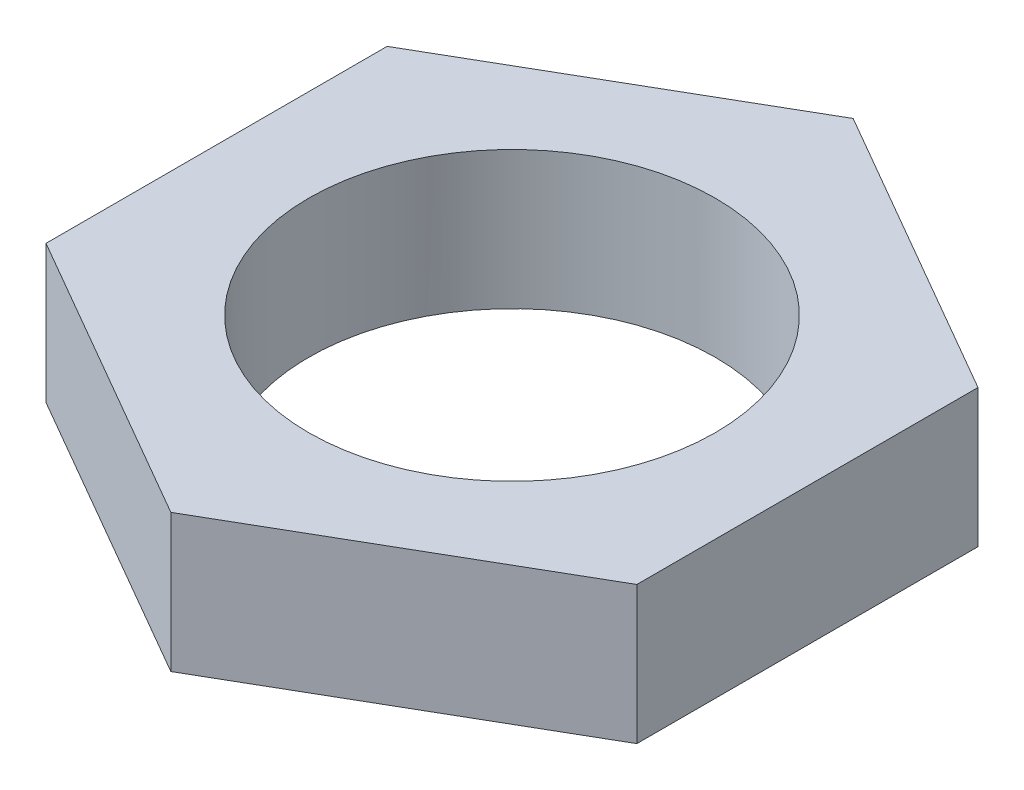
ISO-10303-21;
HEADER;
FILE_DESCRIPTION(('STEP AP214'),'2;1');
FILE_NAME('part.step','',(''),(''),'','','');
FILE_SCHEMA(('AUTOMOTIVE_DESIGN { 1 0 10303 214 1 1 1 1 }'));
ENDSEC;
DATA;
#1=APPLICATION_CONTEXT('core data for automotive mechanical design processes');
#2=APPLICATION_PROTOCOL_DEFINITION('international standard','automotive_design',2000,#1);
#3=PRODUCT_CONTEXT('',#1,'mechanical');
#4=PRODUCT('Part','Part','',(#3));
#5=PRODUCT_RELATED_PRODUCT_CATEGORY('part','',(#4));
#6=PRODUCT_DEFINITION_FORMATION('','',#4);
#7=PRODUCT_DEFINITION_CONTEXT('part definition',#1,'design');
#8=PRODUCT_DEFINITION('design','',#6,#7);
#9=PRODUCT_DEFINITION_SHAPE('','',#8);
#10=(LENGTH_UNIT() NAMED_UNIT(*) SI_UNIT(.MILLI.,.METRE.));
#11=(NAMED_UNIT(*) PLANE_ANGLE_UNIT() SI_UNIT($,.RADIAN.));
#12=(NAMED_UNIT(*) SI_UNIT($,.STERADIAN.) SOLID_ANGLE_UNIT());
#13=UNCERTAINTY_MEASURE_WITH_UNIT(LENGTH_MEASURE(1.E-05),#10,'distance_accuracy_value','');
#14=(GEOMETRIC_REPRESENTATION_CONTEXT(3) GLOBAL_UNCERTAINTY_ASSIGNED_CONTEXT((#13)) GLOBAL_UNIT_ASSIGNED_CONTEXT((#10,
#11,#12)) REPRESENTATION_CONTEXT('',''));
#15=CARTESIAN_POINT('',(0.,0.,0.));
#16=DIRECTION('',(0.,0.,1.));
#17=DIRECTION('',(1.,0.,0.));
#18=AXIS2_PLACEMENT_3D('',#15,#16,#17);
#19=CARTESIAN_POINT('',(15.0000000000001,7.00000000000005,-8.66025403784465));
#20=DIRECTION('',(-0.500000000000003,0.,0.866025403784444));
#21=DIRECTION('',(0.866025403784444,0.,0.500000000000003));
#22=AXIS2_PLACEMENT_3D('',#19,#20,#21);
#23=PLANE('',#22);
#24=DIRECTION('',(-0.866025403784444,0.,-0.500000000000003));
#25=VECTOR('',#24,1.);
#26=CARTESIAN_POINT('',(15.0000000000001,0.,-8.66025403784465));
#27=LINE('',#26,#25);
#28=CARTESIAN_POINT('',(15.0000000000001,0.,-8.66025403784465));
#29=VERTEX_POINT('',#28);
#30=CARTESIAN_POINT('',(0.,0.,-17.320508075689));
#31=VERTEX_POINT('',#30);
#32=EDGE_CURVE('E121',#29,#31,#27,.T.);
#33=ORIENTED_EDGE('',*,*,#32,.T.);
#34=DIRECTION('',(0.,-1.,0.));
#35=VECTOR('',#34,1.);
#36=CARTESIAN_POINT('',(0.,7.00000000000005,-17.3205080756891));
#37=LINE('',#36,#35);
#38=CARTESIAN_POINT('',(0.,7.00000000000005,-17.3205080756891));
#39=VERTEX_POINT('',#38);
#40=EDGE_CURVE('E11',#39,#31,#37,.T.);
#41=ORIENTED_EDGE('',*,*,#40,.F.);
#42=DIRECTION('',(-0.866025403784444,0.,-0.500000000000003));
#43=VECTOR('',#42,1.);
#44=CARTESIAN_POINT('',(15.0000000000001,7.00000000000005,-8.66025403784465));
#45=LINE('',#44,#43);
#46=CARTESIAN_POINT('',(15.0000000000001,7.00000000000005,-8.66025403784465));
#47=VERTEX_POINT('',#46);
#48=EDGE_CURVE('E132',#47,#39,#45,.T.);
#49=ORIENTED_EDGE('',*,*,#48,.F.);
#50=DIRECTION('',(0.,-1.,0.));
#51=VECTOR('',#50,1.);
#52=CARTESIAN_POINT('',(15.0000000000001,7.00000000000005,-8.66025403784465));
#53=LINE('',#52,#51);
#54=EDGE_CURVE('E117',#47,#29,#53,.T.);
#55=ORIENTED_EDGE('',*,*,#54,.T.);
#56=EDGE_LOOP('',(#33,#41,#49,#55));
#57=FACE_BOUND('',#56,.T.);
#58=ADVANCED_FACE('F37',(#57),#23,.F.);
#59=CARTESIAN_POINT('',(0.,7.00000000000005,-17.3205080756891));
#60=DIRECTION('',(0.500000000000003,0.,0.866025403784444));
#61=DIRECTION('',(0.866025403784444,0.,-0.500000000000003));
#62=AXIS2_PLACEMENT_3D('',#59,#60,#61);
#63=PLANE('',#62);
#64=DIRECTION('',(-0.866025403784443,0.,0.500000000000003));
#65=VECTOR('',#64,1.);
#66=CARTESIAN_POINT('',(0.,0.,-17.320508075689));
#67=LINE('',#66,#65);
#68=CARTESIAN_POINT('',(-15.0000000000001,0.,-8.66025403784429));
#69=VERTEX_POINT('',#68);
#70=EDGE_CURVE('E124',#31,#69,#67,.T.);
#71=ORIENTED_EDGE('',*,*,#70,.T.);
#72=DIRECTION('',(0.,-1.,0.));
#73=VECTOR('',#72,1.);
#74=CARTESIAN_POINT('',(-15.,7.00000000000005,-8.66025403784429));
#75=LINE('',#74,#73);
#76=CARTESIAN_POINT('',(-15.,7.00000000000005,-8.66025403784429));
#77=VERTEX_POINT('',#76);
#78=EDGE_CURVE('E45',#77,#69,#75,.T.);
#79=ORIENTED_EDGE('',*,*,#78,.F.);
#80=DIRECTION('',(-0.866025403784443,0.,0.500000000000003));
#81=VECTOR('',#80,1.);
#82=CARTESIAN_POINT('',(0.,7.00000000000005,-17.3205080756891));
#83=LINE('',#82,#81);
#84=EDGE_CURVE('E90',#39,#77,#83,.T.);
#85=ORIENTED_EDGE('',*,*,#84,.F.);
#86=ORIENTED_EDGE('',*,*,#40,.T.);
#87=EDGE_LOOP('',(#71,#79,#85,#86));
#88=FACE_BOUND('',#87,.T.);
#89=ADVANCED_FACE('F157',(#88),#63,.F.);
#90=CARTESIAN_POINT('',(-15.,7.00000000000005,-8.66025403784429));
#91=DIRECTION('',(1.00000000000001,0.,0.));
#92=DIRECTION('',(0.,0.,-1.00000000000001));
#93=AXIS2_PLACEMENT_3D('',#90,#91,#92);
#94=PLANE('',#93);
#95=DIRECTION('',(0.,0.,1.00000000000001));
#96=VECTOR('',#95,1.);
#97=CARTESIAN_POINT('',(-15.0000000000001,0.,-8.66025403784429));
#98=LINE('',#97,#96);
#99=CARTESIAN_POINT('',(-15.0000000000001,0.,8.66025403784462));
#100=VERTEX_POINT('',#99);
#101=EDGE_CURVE('E127',#69,#100,#98,.T.);
#102=ORIENTED_EDGE('',*,*,#101,.T.);
#103=DIRECTION('',(0.,-1.,0.));
#104=VECTOR('',#103,1.);
#105=CARTESIAN_POINT('',(-15.,7.00000000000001,8.66025403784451));
#106=LINE('',#105,#104);
#107=CARTESIAN_POINT('',(-15.,7.00000000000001,8.66025403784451));
#108=VERTEX_POINT('',#107);
#109=EDGE_CURVE('E112',#108,#100,#106,.T.);
#110=ORIENTED_EDGE('',*,*,#109,.F.);
#111=DIRECTION('',(0.,0.,1.00000000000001));
#112=VECTOR('',#111,1.);
#113=CARTESIAN_POINT('',(-15.,7.00000000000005,-8.66025403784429));
#114=LINE('',#113,#112);
#115=EDGE_CURVE('E103',#77,#108,#114,.T.);
#116=ORIENTED_EDGE('',*,*,#115,.F.);
#117=ORIENTED_EDGE('',*,*,#78,.T.);
#118=EDGE_LOOP('',(#102,#110,#116,#117));
#119=FACE_BOUND('',#118,.T.);
#120=ADVANCED_FACE('F138',(#119),#94,.F.);
#121=CARTESIAN_POINT('',(-15.,7.00000000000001,8.66025403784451));
#122=DIRECTION('',(0.500000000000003,0.,-0.866025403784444));
#123=DIRECTION('',(-0.866025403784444,0.,-0.500000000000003));
#124=AXIS2_PLACEMENT_3D('',#121,#122,#123);
#125=PLANE('',#124);
#126=DIRECTION('',(0.866025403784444,0.,0.500000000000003));
#127=VECTOR('',#126,1.);
#128=CARTESIAN_POINT('',(-15.0000000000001,0.,8.66025403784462));
#129=LINE('',#128,#127);
#130=CARTESIAN_POINT('',(-1.11022302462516E-13,0.,17.3205080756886));
#131=VERTEX_POINT('',#130);
#132=EDGE_CURVE('E111',#100,#131,#129,.T.);
#133=ORIENTED_EDGE('',*,*,#132,.T.);
#134=DIRECTION('',(0.,-1.,0.));
#135=VECTOR('',#134,1.);
#136=CARTESIAN_POINT('',(-1.11022302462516E-13,7.00000000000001,17.3205080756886));
#137=LINE('',#136,#135);
#138=CARTESIAN_POINT('',(-1.11022302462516E-13,7.00000000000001,17.3205080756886));
#139=VERTEX_POINT('',#138);
#140=EDGE_CURVE('E108',#139,#131,#137,.T.);
#141=ORIENTED_EDGE('',*,*,#140,.F.);
#142=DIRECTION('',(0.866025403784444,0.,0.500000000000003));
#143=VECTOR('',#142,1.);
#144=CARTESIAN_POINT('',(-15.,7.00000000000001,8.66025403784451));
#145=LINE('',#144,#143);
#146=EDGE_CURVE('E97',#108,#139,#145,.T.);
#147=ORIENTED_EDGE('',*,*,#146,.F.);
#148=ORIENTED_EDGE('',*,*,#109,.T.);
#149=EDGE_LOOP('',(#133,#141,#147,#148));
#150=FACE_BOUND('',#149,.T.);
#151=ADVANCED_FACE('F109',(#150),#125,.F.);
#152=CARTESIAN_POINT('',(-1.11022302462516E-13,7.00000000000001,17.3205080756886));
#153=DIRECTION('',(-0.500000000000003,0.,-0.866025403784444));
#154=DIRECTION('',(-0.866025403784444,0.,0.500000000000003));
#155=AXIS2_PLACEMENT_3D('',#152,#153,#154);
#156=PLANE('',#155);
#157=DIRECTION('',(0.866025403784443,0.,-0.500000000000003));
#158=VECTOR('',#157,1.);
#159=CARTESIAN_POINT('',(-1.11022302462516E-13,0.,17.3205080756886));
#160=LINE('',#159,#158);
#161=CARTESIAN_POINT('',(14.9999999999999,0.,8.66025403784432));
#162=VERTEX_POINT('',#161);
#163=EDGE_CURVE('E76',#131,#162,#160,.T.);
#164=ORIENTED_EDGE('',*,*,#163,.T.);
#165=DIRECTION('',(0.,-1.,0.));
#166=VECTOR('',#165,1.);
#167=CARTESIAN_POINT('',(14.9999999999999,7.00000000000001,8.66025403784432));
#168=LINE('',#167,#166);
#169=CARTESIAN_POINT('',(14.9999999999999,7.00000000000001,8.66025403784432));
#170=VERTEX_POINT('',#169);
#171=EDGE_CURVE('E113',#170,#162,#168,.T.);
#172=ORIENTED_EDGE('',*,*,#171,.F.);
#173=DIRECTION('',(0.866025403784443,0.,-0.500000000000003));
#174=VECTOR('',#173,1.);
#175=CARTESIAN_POINT('',(-1.11022302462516E-13,7.00000000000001,17.3205080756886));
#176=LINE('',#175,#174);
#177=EDGE_CURVE('E101',#139,#170,#176,.T.);
#178=ORIENTED_EDGE('',*,*,#177,.F.);
#179=ORIENTED_EDGE('',*,*,#140,.T.);
#180=EDGE_LOOP('',(#164,#172,#178,#179));
#181=FACE_BOUND('',#180,.T.);
#182=ADVANCED_FACE('F115',(#181),#156,.F.);
#183=CARTESIAN_POINT('',(14.9999999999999,7.00000000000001,8.66025403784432));
#184=DIRECTION('',(-1.00000000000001,0.,0.));
#185=DIRECTION('',(0.,0.,1.00000000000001));
#186=AXIS2_PLACEMENT_3D('',#183,#184,#185);
#187=PLANE('',#186);
#188=DIRECTION('',(0.,0.,-1.00000000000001));
#189=VECTOR('',#188,1.);
#190=CARTESIAN_POINT('',(14.9999999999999,0.,8.66025403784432));
#191=LINE('',#190,#189);
#192=EDGE_CURVE('E82',#162,#29,#191,.T.);
#193=ORIENTED_EDGE('',*,*,#192,.T.);
#194=ORIENTED_EDGE('',*,*,#54,.F.);
#195=DIRECTION('',(0.,0.,-1.00000000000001));
#196=VECTOR('',#195,1.);
#197=CARTESIAN_POINT('',(14.9999999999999,7.00000000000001,8.66025403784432));
#198=LINE('',#197,#196);
#199=EDGE_CURVE('E53',#170,#47,#198,.T.);
#200=ORIENTED_EDGE('',*,*,#199,.F.);
#201=ORIENTED_EDGE('',*,*,#171,.T.);
#202=EDGE_LOOP('',(#193,#194,#200,#201));
#203=FACE_BOUND('',#202,.T.);
#204=ADVANCED_FACE('F145',(#203),#187,.F.);
#205=CARTESIAN_POINT('',(0.,7.00000000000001,0.));
#206=DIRECTION('',(0.,1.,0.));
#207=DIRECTION('',(0.,0.,1.00000000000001));
#208=AXIS2_PLACEMENT_3D('',#205,#206,#207);
#209=PLANE('',#208);
#210=CARTESIAN_POINT('',(0.,7.00000000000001,0.));
#211=DIRECTION('',(0.,1.,0.));
#212=DIRECTION('',(0.,0.,1.00000000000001));
#213=AXIS2_PLACEMENT_3D('',#210,#211,#212);
#214=CIRCLE('',#213,10.31875);
#215=CARTESIAN_POINT('',(0.,7.00000000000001,10.3187500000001));
#216=VERTEX_POINT('',#215);
#217=EDGE_CURVE('E125',#216,#216,#214,.T.);
#218=ORIENTED_EDGE('',*,*,#217,.F.);
#219=EDGE_LOOP('',(#218));
#220=FACE_BOUND('',#219,.T.);
#221=ORIENTED_EDGE('',*,*,#48,.T.);
#222=ORIENTED_EDGE('',*,*,#84,.T.);
#223=ORIENTED_EDGE('',*,*,#115,.T.);
#224=ORIENTED_EDGE('',*,*,#146,.T.);
#225=ORIENTED_EDGE('',*,*,#177,.T.);
#226=ORIENTED_EDGE('',*,*,#199,.T.);
#227=EDGE_LOOP('',(#221,#222,#223,#224,#225,#226));
#228=FACE_BOUND('',#227,.T.);
#229=ADVANCED_FACE('F99',(#220,#228),#209,.T.);
#230=CARTESIAN_POINT('',(0.,0.,0.));
#231=DIRECTION('',(0.,1.,0.));
#232=DIRECTION('',(0.,0.,1.00000000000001));
#233=AXIS2_PLACEMENT_3D('',#230,#231,#232);
#234=PLANE('',#233);
#235=CARTESIAN_POINT('',(0.,0.,0.));
#236=DIRECTION('',(0.,-1.,0.));
#237=DIRECTION('',(0.,0.,-1.00000000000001));
#238=AXIS2_PLACEMENT_3D('',#235,#236,#237);
#239=CIRCLE('',#238,10.31875);
#240=CARTESIAN_POINT('',(0.,0.,-10.3187500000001));
#241=VERTEX_POINT('',#240);
#242=EDGE_CURVE('E204',#241,#241,#239,.T.);
#243=ORIENTED_EDGE('',*,*,#242,.F.);
#244=EDGE_LOOP('',(#243));
#245=FACE_BOUND('',#244,.T.);
#246=ORIENTED_EDGE('',*,*,#32,.F.);
#247=ORIENTED_EDGE('',*,*,#192,.F.);
#248=ORIENTED_EDGE('',*,*,#163,.F.);
#249=ORIENTED_EDGE('',*,*,#132,.F.);
#250=ORIENTED_EDGE('',*,*,#101,.F.);
#251=ORIENTED_EDGE('',*,*,#70,.F.);
#252=EDGE_LOOP('',(#246,#247,#248,#249,#250,#251));
#253=FACE_BOUND('',#252,.T.);
#254=ADVANCED_FACE('F141',(#245,#253),#234,.F.);
#255=CARTESIAN_POINT('',(0.,0.,0.));
#256=DIRECTION('',(0.,-1.,0.));
#257=DIRECTION('',(0.,0.,-1.00000000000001));
#258=AXIS2_PLACEMENT_3D('',#255,#256,#257);
#259=CYLINDRICAL_SURFACE('',#258,10.31875);
#260=ORIENTED_EDGE('',*,*,#217,.T.);
#261=EDGE_LOOP('',(#260));
#262=FACE_BOUND('',#261,.T.);
#263=ORIENTED_EDGE('',*,*,#242,.T.);
#264=EDGE_LOOP('',(#263));
#265=FACE_BOUND('',#264,.T.);
#266=ADVANCED_FACE('F188',(#262,#265),#259,.F.);
#267=CLOSED_SHELL('',(#58,#89,#120,#151,#182,#204,#229,#254,#266));
#268=MANIFOLD_SOLID_BREP('B2',#267);
#269=ADVANCED_BREP_SHAPE_REPRESENTATION('',(#18,#268),#14);
#270=SHAPE_DEFINITION_REPRESENTATION(#9,#269);
ENDSEC;
END-ISO-10303-21;
